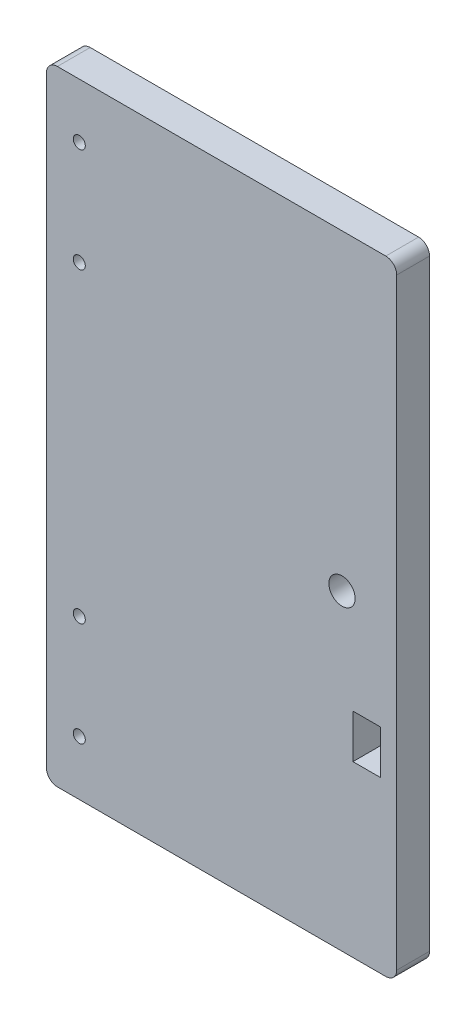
ISO-10303-21;
HEADER;
FILE_DESCRIPTION(('STEP AP214'),'2;1');
FILE_NAME('part.step','',(''),(''),'','','');
FILE_SCHEMA(('AUTOMOTIVE_DESIGN { 1 0 10303 214 1 1 1 1 }'));
ENDSEC;
DATA;
#1=APPLICATION_CONTEXT('core data for automotive mechanical design processes');
#2=APPLICATION_PROTOCOL_DEFINITION('international standard','automotive_design',2000,#1);
#3=PRODUCT_CONTEXT('',#1,'mechanical');
#4=PRODUCT('Part','Part','',(#3));
#5=PRODUCT_RELATED_PRODUCT_CATEGORY('part','',(#4));
#6=PRODUCT_DEFINITION_FORMATION('','',#4);
#7=PRODUCT_DEFINITION_CONTEXT('part definition',#1,'design');
#8=PRODUCT_DEFINITION('design','',#6,#7);
#9=PRODUCT_DEFINITION_SHAPE('','',#8);
#10=(LENGTH_UNIT() NAMED_UNIT(*) SI_UNIT(.MILLI.,.METRE.));
#11=(NAMED_UNIT(*) PLANE_ANGLE_UNIT() SI_UNIT($,.RADIAN.));
#12=(NAMED_UNIT(*) SI_UNIT($,.STERADIAN.) SOLID_ANGLE_UNIT());
#13=UNCERTAINTY_MEASURE_WITH_UNIT(LENGTH_MEASURE(1.E-05),#10,'distance_accuracy_value','');
#14=(GEOMETRIC_REPRESENTATION_CONTEXT(3) GLOBAL_UNCERTAINTY_ASSIGNED_CONTEXT((#13)) GLOBAL_UNIT_ASSIGNED_CONTEXT((#10,
#11,#12)) REPRESENTATION_CONTEXT('',''));
#15=CARTESIAN_POINT('',(0.,0.,0.));
#16=DIRECTION('',(0.,0.,1.));
#17=DIRECTION('',(1.,0.,0.));
#18=AXIS2_PLACEMENT_3D('',#15,#16,#17);
#19=CARTESIAN_POINT('',(2.,112.,6.));
#20=DIRECTION('',(0.,0.,-1.));
#21=DIRECTION('',(-1.,0.,0.));
#22=AXIS2_PLACEMENT_3D('',#19,#20,#21);
#23=CYLINDRICAL_SURFACE('',#22,2.);
#24=CARTESIAN_POINT('',(2.,112.,0.));
#25=DIRECTION('',(0.,0.,1.));
#26=DIRECTION('',(1.,0.,0.));
#27=AXIS2_PLACEMENT_3D('',#24,#25,#26);
#28=CIRCLE('',#27,2.);
#29=CARTESIAN_POINT('',(2.00000000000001,114.,0.));
#30=VERTEX_POINT('',#29);
#31=CARTESIAN_POINT('',(0.,112.,0.));
#32=VERTEX_POINT('',#31);
#33=EDGE_CURVE('E180',#30,#32,#28,.T.);
#34=ORIENTED_EDGE('',*,*,#33,.T.);
#35=DIRECTION('',(0.,0.,-1.));
#36=VECTOR('',#35,1.);
#37=CARTESIAN_POINT('',(0.,112.,6.));
#38=LINE('',#37,#36);
#39=CARTESIAN_POINT('',(0.,112.,6.));
#40=VERTEX_POINT('',#39);
#41=EDGE_CURVE('E11',#40,#32,#38,.T.);
#42=ORIENTED_EDGE('',*,*,#41,.F.);
#43=CARTESIAN_POINT('',(2.,112.,6.));
#44=DIRECTION('',(0.,0.,1.));
#45=DIRECTION('',(1.,0.,0.));
#46=AXIS2_PLACEMENT_3D('',#43,#44,#45);
#47=CIRCLE('',#46,2.);
#48=CARTESIAN_POINT('',(2.00000000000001,114.,6.));
#49=VERTEX_POINT('',#48);
#50=EDGE_CURVE('E197',#49,#40,#47,.T.);
#51=ORIENTED_EDGE('',*,*,#50,.F.);
#52=DIRECTION('',(0.,0.,-1.));
#53=VECTOR('',#52,1.);
#54=CARTESIAN_POINT('',(2.00000000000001,114.,6.));
#55=LINE('',#54,#53);
#56=EDGE_CURVE('E214',#49,#30,#55,.T.);
#57=ORIENTED_EDGE('',*,*,#56,.T.);
#58=EDGE_LOOP('',(#34,#42,#51,#57));
#59=FACE_BOUND('',#58,.T.);
#60=ADVANCED_FACE('F26',(#59),#23,.T.);
#61=CARTESIAN_POINT('',(0.,2.00000000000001,6.));
#62=DIRECTION('',(1.,0.,0.));
#63=DIRECTION('',(0.,0.,-1.));
#64=AXIS2_PLACEMENT_3D('',#61,#62,#63);
#65=PLANE('',#64);
#66=DIRECTION('',(0.,-1.,0.));
#67=VECTOR('',#66,1.);
#68=CARTESIAN_POINT('',(0.,2.00000000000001,0.));
#69=LINE('',#68,#67);
#70=CARTESIAN_POINT('',(0.,2.00000000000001,0.));
#71=VERTEX_POINT('',#70);
#72=EDGE_CURVE('E183',#32,#71,#69,.T.);
#73=ORIENTED_EDGE('',*,*,#72,.T.);
#74=DIRECTION('',(0.,0.,-1.));
#75=VECTOR('',#74,1.);
#76=CARTESIAN_POINT('',(0.,2.00000000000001,6.));
#77=LINE('',#76,#75);
#78=CARTESIAN_POINT('',(0.,2.00000000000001,6.));
#79=VERTEX_POINT('',#78);
#80=EDGE_CURVE('E33',#79,#71,#77,.T.);
#81=ORIENTED_EDGE('',*,*,#80,.F.);
#82=DIRECTION('',(0.,-1.,0.));
#83=VECTOR('',#82,1.);
#84=CARTESIAN_POINT('',(0.,2.00000000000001,6.));
#85=LINE('',#84,#83);
#86=EDGE_CURVE('E200',#40,#79,#85,.T.);
#87=ORIENTED_EDGE('',*,*,#86,.F.);
#88=ORIENTED_EDGE('',*,*,#41,.T.);
#89=EDGE_LOOP('',(#73,#81,#87,#88));
#90=FACE_BOUND('',#89,.T.);
#91=ADVANCED_FACE('F258',(#90),#65,.F.);
#92=CARTESIAN_POINT('',(2.,2.,6.));
#93=DIRECTION('',(0.,0.,-1.));
#94=DIRECTION('',(-1.,0.,0.));
#95=AXIS2_PLACEMENT_3D('',#92,#93,#94);
#96=CYLINDRICAL_SURFACE('',#95,2.);
#97=CARTESIAN_POINT('',(2.,2.,0.));
#98=DIRECTION('',(0.,0.,1.));
#99=DIRECTION('',(-1.,0.,0.));
#100=AXIS2_PLACEMENT_3D('',#97,#98,#99);
#101=CIRCLE('',#100,2.);
#102=CARTESIAN_POINT('',(2.00000000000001,0.,0.));
#103=VERTEX_POINT('',#102);
#104=EDGE_CURVE('E185',#71,#103,#101,.T.);
#105=ORIENTED_EDGE('',*,*,#104,.T.);
#106=DIRECTION('',(0.,0.,-1.));
#107=VECTOR('',#106,1.);
#108=CARTESIAN_POINT('',(2.00000000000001,0.,6.));
#109=LINE('',#108,#107);
#110=CARTESIAN_POINT('',(2.00000000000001,0.,6.));
#111=VERTEX_POINT('',#110);
#112=EDGE_CURVE('E229',#111,#103,#109,.T.);
#113=ORIENTED_EDGE('',*,*,#112,.F.);
#114=CARTESIAN_POINT('',(2.,2.,6.));
#115=DIRECTION('',(0.,0.,1.));
#116=DIRECTION('',(-1.,0.,0.));
#117=AXIS2_PLACEMENT_3D('',#114,#115,#116);
#118=CIRCLE('',#117,2.);
#119=EDGE_CURVE('E202',#79,#111,#118,.T.);
#120=ORIENTED_EDGE('',*,*,#119,.F.);
#121=ORIENTED_EDGE('',*,*,#80,.T.);
#122=EDGE_LOOP('',(#105,#113,#120,#121));
#123=FACE_BOUND('',#122,.T.);
#124=ADVANCED_FACE('F236',(#123),#96,.T.);
#125=CARTESIAN_POINT('',(2.00000000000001,0.,6.));
#126=DIRECTION('',(0.,1.,0.));
#127=DIRECTION('',(0.,0.,1.));
#128=AXIS2_PLACEMENT_3D('',#125,#126,#127);
#129=PLANE('',#128);
#130=DIRECTION('',(1.,0.,0.));
#131=VECTOR('',#130,1.);
#132=CARTESIAN_POINT('',(2.00000000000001,0.,0.));
#133=LINE('',#132,#131);
#134=CARTESIAN_POINT('',(62.,0.,0.));
#135=VERTEX_POINT('',#134);
#136=EDGE_CURVE('E187',#103,#135,#133,.T.);
#137=ORIENTED_EDGE('',*,*,#136,.T.);
#138=DIRECTION('',(0.,0.,-1.));
#139=VECTOR('',#138,1.);
#140=CARTESIAN_POINT('',(62.,0.,6.));
#141=LINE('',#140,#139);
#142=CARTESIAN_POINT('',(62.,0.,6.));
#143=VERTEX_POINT('',#142);
#144=EDGE_CURVE('E226',#143,#135,#141,.T.);
#145=ORIENTED_EDGE('',*,*,#144,.F.);
#146=DIRECTION('',(1.,0.,0.));
#147=VECTOR('',#146,1.);
#148=CARTESIAN_POINT('',(2.00000000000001,0.,6.));
#149=LINE('',#148,#147);
#150=EDGE_CURVE('E204',#111,#143,#149,.T.);
#151=ORIENTED_EDGE('',*,*,#150,.F.);
#152=ORIENTED_EDGE('',*,*,#112,.T.);
#153=EDGE_LOOP('',(#137,#145,#151,#152));
#154=FACE_BOUND('',#153,.T.);
#155=ADVANCED_FACE('F247',(#154),#129,.F.);
#156=CARTESIAN_POINT('',(62.,2.,6.));
#157=DIRECTION('',(0.,0.,-1.));
#158=DIRECTION('',(-1.,0.,0.));
#159=AXIS2_PLACEMENT_3D('',#156,#157,#158);
#160=CYLINDRICAL_SURFACE('',#159,2.);
#161=CARTESIAN_POINT('',(62.,2.,0.));
#162=DIRECTION('',(0.,0.,1.));
#163=DIRECTION('',(-1.,0.,0.));
#164=AXIS2_PLACEMENT_3D('',#161,#162,#163);
#165=CIRCLE('',#164,2.);
#166=CARTESIAN_POINT('',(64.,2.00000000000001,0.));
#167=VERTEX_POINT('',#166);
#168=EDGE_CURVE('E189',#135,#167,#165,.T.);
#169=ORIENTED_EDGE('',*,*,#168,.T.);
#170=DIRECTION('',(0.,0.,-1.));
#171=VECTOR('',#170,1.);
#172=CARTESIAN_POINT('',(64.,2.00000000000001,6.));
#173=LINE('',#172,#171);
#174=CARTESIAN_POINT('',(64.,2.00000000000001,6.));
#175=VERTEX_POINT('',#174);
#176=EDGE_CURVE('E223',#175,#167,#173,.T.);
#177=ORIENTED_EDGE('',*,*,#176,.F.);
#178=CARTESIAN_POINT('',(62.,2.,6.));
#179=DIRECTION('',(0.,0.,1.));
#180=DIRECTION('',(-1.,0.,0.));
#181=AXIS2_PLACEMENT_3D('',#178,#179,#180);
#182=CIRCLE('',#181,2.);
#183=EDGE_CURVE('E206',#143,#175,#182,.T.);
#184=ORIENTED_EDGE('',*,*,#183,.F.);
#185=ORIENTED_EDGE('',*,*,#144,.T.);
#186=EDGE_LOOP('',(#169,#177,#184,#185));
#187=FACE_BOUND('',#186,.T.);
#188=ADVANCED_FACE('F251',(#187),#160,.T.);
#189=CARTESIAN_POINT('',(64.,2.00000000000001,6.));
#190=DIRECTION('',(-1.,0.,0.));
#191=DIRECTION('',(0.,0.,1.));
#192=AXIS2_PLACEMENT_3D('',#189,#190,#191);
#193=PLANE('',#192);
#194=DIRECTION('',(0.,1.,0.));
#195=VECTOR('',#194,1.);
#196=CARTESIAN_POINT('',(64.,2.00000000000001,0.));
#197=LINE('',#196,#195);
#198=CARTESIAN_POINT('',(64.,112.,0.));
#199=VERTEX_POINT('',#198);
#200=EDGE_CURVE('E191',#167,#199,#197,.T.);
#201=ORIENTED_EDGE('',*,*,#200,.T.);
#202=DIRECTION('',(0.,0.,-1.));
#203=VECTOR('',#202,1.);
#204=CARTESIAN_POINT('',(64.,112.,6.));
#205=LINE('',#204,#203);
#206=CARTESIAN_POINT('',(64.,112.,6.));
#207=VERTEX_POINT('',#206);
#208=EDGE_CURVE('E220',#207,#199,#205,.T.);
#209=ORIENTED_EDGE('',*,*,#208,.F.);
#210=DIRECTION('',(0.,1.,0.));
#211=VECTOR('',#210,1.);
#212=CARTESIAN_POINT('',(64.,2.00000000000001,6.));
#213=LINE('',#212,#211);
#214=EDGE_CURVE('E208',#175,#207,#213,.T.);
#215=ORIENTED_EDGE('',*,*,#214,.F.);
#216=ORIENTED_EDGE('',*,*,#176,.T.);
#217=EDGE_LOOP('',(#201,#209,#215,#216));
#218=FACE_BOUND('',#217,.T.);
#219=ADVANCED_FACE('F271',(#218),#193,.F.);
#220=CARTESIAN_POINT('',(62.,112.,6.));
#221=DIRECTION('',(0.,0.,-1.));
#222=DIRECTION('',(-1.,0.,0.));
#223=AXIS2_PLACEMENT_3D('',#220,#221,#222);
#224=CYLINDRICAL_SURFACE('',#223,2.);
#225=CARTESIAN_POINT('',(62.,112.,0.));
#226=DIRECTION('',(0.,0.,1.));
#227=DIRECTION('',(-1.,0.,0.));
#228=AXIS2_PLACEMENT_3D('',#225,#226,#227);
#229=CIRCLE('',#228,2.);
#230=CARTESIAN_POINT('',(62.,114.,0.));
#231=VERTEX_POINT('',#230);
#232=EDGE_CURVE('E193',#199,#231,#229,.T.);
#233=ORIENTED_EDGE('',*,*,#232,.T.);
#234=DIRECTION('',(0.,0.,-1.));
#235=VECTOR('',#234,1.);
#236=CARTESIAN_POINT('',(62.,114.,6.));
#237=LINE('',#236,#235);
#238=CARTESIAN_POINT('',(62.,114.,6.));
#239=VERTEX_POINT('',#238);
#240=EDGE_CURVE('E217',#239,#231,#237,.T.);
#241=ORIENTED_EDGE('',*,*,#240,.F.);
#242=CARTESIAN_POINT('',(62.,112.,6.));
#243=DIRECTION('',(0.,0.,1.));
#244=DIRECTION('',(-1.,0.,0.));
#245=AXIS2_PLACEMENT_3D('',#242,#243,#244);
#246=CIRCLE('',#245,2.);
#247=EDGE_CURVE('E210',#207,#239,#246,.T.);
#248=ORIENTED_EDGE('',*,*,#247,.F.);
#249=ORIENTED_EDGE('',*,*,#208,.T.);
#250=EDGE_LOOP('',(#233,#241,#248,#249));
#251=FACE_BOUND('',#250,.T.);
#252=ADVANCED_FACE('F269',(#251),#224,.T.);
#253=CARTESIAN_POINT('',(2.00000000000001,114.,6.));
#254=DIRECTION('',(0.,-1.,0.));
#255=DIRECTION('',(1.,0.,0.));
#256=AXIS2_PLACEMENT_3D('',#253,#254,#255);
#257=PLANE('',#256);
#258=DIRECTION('',(-1.,0.,0.));
#259=VECTOR('',#258,1.);
#260=CARTESIAN_POINT('',(2.00000000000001,114.,0.));
#261=LINE('',#260,#259);
#262=EDGE_CURVE('E195',#231,#30,#261,.T.);
#263=ORIENTED_EDGE('',*,*,#262,.T.);
#264=ORIENTED_EDGE('',*,*,#56,.F.);
#265=DIRECTION('',(-1.,0.,0.));
#266=VECTOR('',#265,1.);
#267=CARTESIAN_POINT('',(2.00000000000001,114.,6.));
#268=LINE('',#267,#266);
#269=EDGE_CURVE('E212',#239,#49,#268,.T.);
#270=ORIENTED_EDGE('',*,*,#269,.F.);
#271=ORIENTED_EDGE('',*,*,#240,.T.);
#272=EDGE_LOOP('',(#263,#264,#270,#271));
#273=FACE_BOUND('',#272,.T.);
#274=ADVANCED_FACE('F264',(#273),#257,.F.);
#275=CARTESIAN_POINT('',(2.,112.,6.));
#276=DIRECTION('',(0.,0.,1.));
#277=DIRECTION('',(1.,0.,0.));
#278=AXIS2_PLACEMENT_3D('',#275,#276,#277);
#279=PLANE('',#278);
#280=DIRECTION('',(0.,-1.,0.));
#281=VECTOR('',#280,1.);
#282=CARTESIAN_POINT('',(56.,39.,6.));
#283=LINE('',#282,#281);
#284=CARTESIAN_POINT('',(56.,39.,6.));
#285=VERTEX_POINT('',#284);
#286=CARTESIAN_POINT('',(56.,31.,6.));
#287=VERTEX_POINT('',#286);
#288=EDGE_CURVE('E40',#285,#287,#283,.T.);
#289=ORIENTED_EDGE('',*,*,#288,.F.);
#290=DIRECTION('',(-1.,0.,0.));
#291=VECTOR('',#290,1.);
#292=CARTESIAN_POINT('',(56.,39.,6.));
#293=LINE('',#292,#291);
#294=CARTESIAN_POINT('',(61.,39.,6.));
#295=VERTEX_POINT('',#294);
#296=EDGE_CURVE('E132',#295,#285,#293,.T.);
#297=ORIENTED_EDGE('',*,*,#296,.F.);
#298=DIRECTION('',(0.,1.,0.));
#299=VECTOR('',#298,1.);
#300=CARTESIAN_POINT('',(61.,39.,6.));
#301=LINE('',#300,#299);
#302=CARTESIAN_POINT('',(61.,31.,6.));
#303=VERTEX_POINT('',#302);
#304=EDGE_CURVE('E116',#303,#295,#301,.T.);
#305=ORIENTED_EDGE('',*,*,#304,.F.);
#306=DIRECTION('',(1.,0.,0.));
#307=VECTOR('',#306,1.);
#308=CARTESIAN_POINT('',(56.,31.,6.));
#309=LINE('',#308,#307);
#310=EDGE_CURVE('E125',#287,#303,#309,.T.);
#311=ORIENTED_EDGE('',*,*,#310,.F.);
#312=EDGE_LOOP('',(#289,#297,#305,#311));
#313=FACE_BOUND('',#312,.T.);
#314=CARTESIAN_POINT('',(6.00000000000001,10.,6.));
#315=DIRECTION('',(0.,0.,1.));
#316=DIRECTION('',(1.,0.,0.));
#317=AXIS2_PLACEMENT_3D('',#314,#315,#316);
#318=CIRCLE('',#317,1.1);
#319=CARTESIAN_POINT('',(7.10000000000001,10.,6.));
#320=VERTEX_POINT('',#319);
#321=EDGE_CURVE('E148',#320,#320,#318,.T.);
#322=ORIENTED_EDGE('',*,*,#321,.F.);
#323=EDGE_LOOP('',(#322));
#324=FACE_BOUND('',#323,.T.);
#325=CARTESIAN_POINT('',(6.00000000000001,29.,6.));
#326=DIRECTION('',(0.,0.,1.));
#327=DIRECTION('',(1.,0.,0.));
#328=AXIS2_PLACEMENT_3D('',#325,#326,#327);
#329=CIRCLE('',#328,1.1);
#330=CARTESIAN_POINT('',(7.10000000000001,29.,6.));
#331=VERTEX_POINT('',#330);
#332=EDGE_CURVE('E156',#331,#331,#329,.T.);
#333=ORIENTED_EDGE('',*,*,#332,.F.);
#334=EDGE_LOOP('',(#333));
#335=FACE_BOUND('',#334,.T.);
#336=CARTESIAN_POINT('',(6.00000000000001,85.,6.));
#337=DIRECTION('',(0.,0.,1.));
#338=DIRECTION('',(1.,0.,0.));
#339=AXIS2_PLACEMENT_3D('',#336,#337,#338);
#340=CIRCLE('',#339,1.1);
#341=CARTESIAN_POINT('',(7.10000000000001,85.,6.));
#342=VERTEX_POINT('',#341);
#343=EDGE_CURVE('E162',#342,#342,#340,.T.);
#344=ORIENTED_EDGE('',*,*,#343,.F.);
#345=EDGE_LOOP('',(#344));
#346=FACE_BOUND('',#345,.T.);
#347=CARTESIAN_POINT('',(6.,104.,6.));
#348=DIRECTION('',(0.,0.,1.));
#349=DIRECTION('',(1.,0.,0.));
#350=AXIS2_PLACEMENT_3D('',#347,#348,#349);
#351=CIRCLE('',#350,1.1);
#352=CARTESIAN_POINT('',(7.1,104.,6.));
#353=VERTEX_POINT('',#352);
#354=EDGE_CURVE('E168',#353,#353,#351,.T.);
#355=ORIENTED_EDGE('',*,*,#354,.F.);
#356=EDGE_LOOP('',(#355));
#357=FACE_BOUND('',#356,.T.);
#358=CARTESIAN_POINT('',(54.,57.,6.));
#359=DIRECTION('',(0.,0.,1.));
#360=DIRECTION('',(1.,0.,0.));
#361=AXIS2_PLACEMENT_3D('',#358,#359,#360);
#362=CIRCLE('',#361,2.4);
#363=CARTESIAN_POINT('',(56.4,57.,6.));
#364=VERTEX_POINT('',#363);
#365=EDGE_CURVE('E174',#364,#364,#362,.T.);
#366=ORIENTED_EDGE('',*,*,#365,.F.);
#367=EDGE_LOOP('',(#366));
#368=FACE_BOUND('',#367,.T.);
#369=ORIENTED_EDGE('',*,*,#50,.T.);
#370=ORIENTED_EDGE('',*,*,#86,.T.);
#371=ORIENTED_EDGE('',*,*,#119,.T.);
#372=ORIENTED_EDGE('',*,*,#150,.T.);
#373=ORIENTED_EDGE('',*,*,#183,.T.);
#374=ORIENTED_EDGE('',*,*,#214,.T.);
#375=ORIENTED_EDGE('',*,*,#247,.T.);
#376=ORIENTED_EDGE('',*,*,#269,.T.);
#377=EDGE_LOOP('',(#369,#370,#371,#372,#373,#374,#375,#376));
#378=FACE_BOUND('',#377,.T.);
#379=ADVANCED_FACE('F129',(#313,#324,#335,#346,#357,#368,#378),#279,.T.);
#380=CARTESIAN_POINT('',(2.,112.,0.));
#381=DIRECTION('',(0.,0.,1.));
#382=DIRECTION('',(1.,0.,0.));
#383=AXIS2_PLACEMENT_3D('',#380,#381,#382);
#384=PLANE('',#383);
#385=DIRECTION('',(-1.,0.,0.));
#386=VECTOR('',#385,1.);
#387=CARTESIAN_POINT('',(56.,39.,0.));
#388=LINE('',#387,#386);
#389=CARTESIAN_POINT('',(61.,39.,0.));
#390=VERTEX_POINT('',#389);
#391=CARTESIAN_POINT('',(56.,39.,0.));
#392=VERTEX_POINT('',#391);
#393=EDGE_CURVE('E143',#390,#392,#388,.T.);
#394=ORIENTED_EDGE('',*,*,#393,.T.);
#395=DIRECTION('',(0.,-1.,0.));
#396=VECTOR('',#395,1.);
#397=CARTESIAN_POINT('',(56.,39.,0.));
#398=LINE('',#397,#396);
#399=CARTESIAN_POINT('',(56.,31.,0.));
#400=VERTEX_POINT('',#399);
#401=EDGE_CURVE('E134',#392,#400,#398,.T.);
#402=ORIENTED_EDGE('',*,*,#401,.T.);
#403=DIRECTION('',(1.,0.,0.));
#404=VECTOR('',#403,1.);
#405=CARTESIAN_POINT('',(56.,31.,0.));
#406=LINE('',#405,#404);
#407=CARTESIAN_POINT('',(61.,31.,0.));
#408=VERTEX_POINT('',#407);
#409=EDGE_CURVE('E140',#400,#408,#406,.T.);
#410=ORIENTED_EDGE('',*,*,#409,.T.);
#411=DIRECTION('',(0.,1.,0.));
#412=VECTOR('',#411,1.);
#413=CARTESIAN_POINT('',(61.,39.,0.));
#414=LINE('',#413,#412);
#415=EDGE_CURVE('E48',#408,#390,#414,.T.);
#416=ORIENTED_EDGE('',*,*,#415,.T.);
#417=EDGE_LOOP('',(#394,#402,#410,#416));
#418=FACE_BOUND('',#417,.T.);
#419=CARTESIAN_POINT('',(6.00000000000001,10.,0.));
#420=DIRECTION('',(0.,0.,1.));
#421=DIRECTION('',(1.,0.,0.));
#422=AXIS2_PLACEMENT_3D('',#419,#420,#421);
#423=CIRCLE('',#422,1.1);
#424=CARTESIAN_POINT('',(7.10000000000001,10.,0.));
#425=VERTEX_POINT('',#424);
#426=EDGE_CURVE('E153',#425,#425,#423,.T.);
#427=ORIENTED_EDGE('',*,*,#426,.T.);
#428=EDGE_LOOP('',(#427));
#429=FACE_BOUND('',#428,.T.);
#430=CARTESIAN_POINT('',(6.00000000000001,29.,0.));
#431=DIRECTION('',(0.,0.,1.));
#432=DIRECTION('',(1.,0.,0.));
#433=AXIS2_PLACEMENT_3D('',#430,#431,#432);
#434=CIRCLE('',#433,1.1);
#435=CARTESIAN_POINT('',(7.10000000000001,29.,0.));
#436=VERTEX_POINT('',#435);
#437=EDGE_CURVE('E159',#436,#436,#434,.T.);
#438=ORIENTED_EDGE('',*,*,#437,.T.);
#439=EDGE_LOOP('',(#438));
#440=FACE_BOUND('',#439,.T.);
#441=CARTESIAN_POINT('',(6.00000000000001,85.,0.));
#442=DIRECTION('',(0.,0.,1.));
#443=DIRECTION('',(1.,0.,0.));
#444=AXIS2_PLACEMENT_3D('',#441,#442,#443);
#445=CIRCLE('',#444,1.1);
#446=CARTESIAN_POINT('',(7.10000000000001,85.,0.));
#447=VERTEX_POINT('',#446);
#448=EDGE_CURVE('E165',#447,#447,#445,.T.);
#449=ORIENTED_EDGE('',*,*,#448,.T.);
#450=EDGE_LOOP('',(#449));
#451=FACE_BOUND('',#450,.T.);
#452=CARTESIAN_POINT('',(6.,104.,0.));
#453=DIRECTION('',(0.,0.,1.));
#454=DIRECTION('',(1.,0.,0.));
#455=AXIS2_PLACEMENT_3D('',#452,#453,#454);
#456=CIRCLE('',#455,1.1);
#457=CARTESIAN_POINT('',(7.1,104.,0.));
#458=VERTEX_POINT('',#457);
#459=EDGE_CURVE('E171',#458,#458,#456,.T.);
#460=ORIENTED_EDGE('',*,*,#459,.T.);
#461=EDGE_LOOP('',(#460));
#462=FACE_BOUND('',#461,.T.);
#463=CARTESIAN_POINT('',(54.,57.,0.));
#464=DIRECTION('',(0.,0.,1.));
#465=DIRECTION('',(1.,0.,0.));
#466=AXIS2_PLACEMENT_3D('',#463,#464,#465);
#467=CIRCLE('',#466,2.4);
#468=CARTESIAN_POINT('',(56.4,57.,0.));
#469=VERTEX_POINT('',#468);
#470=EDGE_CURVE('E177',#469,#469,#467,.T.);
#471=ORIENTED_EDGE('',*,*,#470,.T.);
#472=EDGE_LOOP('',(#471));
#473=FACE_BOUND('',#472,.T.);
#474=ORIENTED_EDGE('',*,*,#33,.F.);
#475=ORIENTED_EDGE('',*,*,#262,.F.);
#476=ORIENTED_EDGE('',*,*,#232,.F.);
#477=ORIENTED_EDGE('',*,*,#200,.F.);
#478=ORIENTED_EDGE('',*,*,#168,.F.);
#479=ORIENTED_EDGE('',*,*,#136,.F.);
#480=ORIENTED_EDGE('',*,*,#104,.F.);
#481=ORIENTED_EDGE('',*,*,#72,.F.);
#482=EDGE_LOOP('',(#474,#475,#476,#477,#478,#479,#480,#481));
#483=FACE_BOUND('',#482,.T.);
#484=ADVANCED_FACE('F242',(#418,#429,#440,#451,#462,#473,#483),#384,.F.);
#485=CARTESIAN_POINT('',(54.,57.,0.));
#486=DIRECTION('',(0.,0.,1.));
#487=DIRECTION('',(1.,0.,0.));
#488=AXIS2_PLACEMENT_3D('',#485,#486,#487);
#489=CYLINDRICAL_SURFACE('',#488,2.4);
#490=ORIENTED_EDGE('',*,*,#470,.F.);
#491=EDGE_LOOP('',(#490));
#492=FACE_BOUND('',#491,.T.);
#493=ORIENTED_EDGE('',*,*,#365,.T.);
#494=EDGE_LOOP('',(#493));
#495=FACE_BOUND('',#494,.T.);
#496=ADVANCED_FACE('F323',(#492,#495),#489,.F.);
#497=CARTESIAN_POINT('',(6.,104.,0.));
#498=DIRECTION('',(0.,0.,1.));
#499=DIRECTION('',(1.,0.,0.));
#500=AXIS2_PLACEMENT_3D('',#497,#498,#499);
#501=CYLINDRICAL_SURFACE('',#500,1.1);
#502=ORIENTED_EDGE('',*,*,#459,.F.);
#503=EDGE_LOOP('',(#502));
#504=FACE_BOUND('',#503,.T.);
#505=ORIENTED_EDGE('',*,*,#354,.T.);
#506=EDGE_LOOP('',(#505));
#507=FACE_BOUND('',#506,.T.);
#508=ADVANCED_FACE('F331',(#504,#507),#501,.F.);
#509=CARTESIAN_POINT('',(6.00000000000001,85.,0.));
#510=DIRECTION('',(0.,0.,1.));
#511=DIRECTION('',(1.,0.,0.));
#512=AXIS2_PLACEMENT_3D('',#509,#510,#511);
#513=CYLINDRICAL_SURFACE('',#512,1.1);
#514=ORIENTED_EDGE('',*,*,#448,.F.);
#515=EDGE_LOOP('',(#514));
#516=FACE_BOUND('',#515,.T.);
#517=ORIENTED_EDGE('',*,*,#343,.T.);
#518=EDGE_LOOP('',(#517));
#519=FACE_BOUND('',#518,.T.);
#520=ADVANCED_FACE('F339',(#516,#519),#513,.F.);
#521=CARTESIAN_POINT('',(6.00000000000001,29.,0.));
#522=DIRECTION('',(0.,0.,1.));
#523=DIRECTION('',(1.,0.,0.));
#524=AXIS2_PLACEMENT_3D('',#521,#522,#523);
#525=CYLINDRICAL_SURFACE('',#524,1.1);
#526=ORIENTED_EDGE('',*,*,#437,.F.);
#527=EDGE_LOOP('',(#526));
#528=FACE_BOUND('',#527,.T.);
#529=ORIENTED_EDGE('',*,*,#332,.T.);
#530=EDGE_LOOP('',(#529));
#531=FACE_BOUND('',#530,.T.);
#532=ADVANCED_FACE('F347',(#528,#531),#525,.F.);
#533=CARTESIAN_POINT('',(6.00000000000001,10.,0.));
#534=DIRECTION('',(0.,0.,1.));
#535=DIRECTION('',(1.,0.,0.));
#536=AXIS2_PLACEMENT_3D('',#533,#534,#535);
#537=CYLINDRICAL_SURFACE('',#536,1.1);
#538=ORIENTED_EDGE('',*,*,#426,.F.);
#539=EDGE_LOOP('',(#538));
#540=FACE_BOUND('',#539,.T.);
#541=ORIENTED_EDGE('',*,*,#321,.T.);
#542=EDGE_LOOP('',(#541));
#543=FACE_BOUND('',#542,.T.);
#544=ADVANCED_FACE('F355',(#540,#543),#537,.F.);
#545=CARTESIAN_POINT('',(56.,39.,0.));
#546=DIRECTION('',(-1.,0.,0.));
#547=DIRECTION('',(0.,-1.,0.));
#548=AXIS2_PLACEMENT_3D('',#545,#546,#547);
#549=PLANE('',#548);
#550=ORIENTED_EDGE('',*,*,#288,.T.);
#551=DIRECTION('',(0.,0.,1.));
#552=VECTOR('',#551,1.);
#553=CARTESIAN_POINT('',(56.,31.,0.));
#554=LINE('',#553,#552);
#555=EDGE_CURVE('E122',#400,#287,#554,.T.);
#556=ORIENTED_EDGE('',*,*,#555,.F.);
#557=ORIENTED_EDGE('',*,*,#401,.F.);
#558=DIRECTION('',(0.,0.,1.));
#559=VECTOR('',#558,1.);
#560=CARTESIAN_POINT('',(56.,39.,0.));
#561=LINE('',#560,#559);
#562=EDGE_CURVE('E146',#392,#285,#561,.T.);
#563=ORIENTED_EDGE('',*,*,#562,.T.);
#564=EDGE_LOOP('',(#550,#556,#557,#563));
#565=FACE_BOUND('',#564,.T.);
#566=ADVANCED_FACE('F363',(#565),#549,.F.);
#567=CARTESIAN_POINT('',(56.,39.,0.));
#568=DIRECTION('',(0.,1.,0.));
#569=DIRECTION('',(0.,0.,1.));
#570=AXIS2_PLACEMENT_3D('',#567,#568,#569);
#571=PLANE('',#570);
#572=ORIENTED_EDGE('',*,*,#296,.T.);
#573=ORIENTED_EDGE('',*,*,#562,.F.);
#574=ORIENTED_EDGE('',*,*,#393,.F.);
#575=DIRECTION('',(0.,0.,1.));
#576=VECTOR('',#575,1.);
#577=CARTESIAN_POINT('',(61.,39.,0.));
#578=LINE('',#577,#576);
#579=EDGE_CURVE('E121',#390,#295,#578,.T.);
#580=ORIENTED_EDGE('',*,*,#579,.T.);
#581=EDGE_LOOP('',(#572,#573,#574,#580));
#582=FACE_BOUND('',#581,.T.);
#583=ADVANCED_FACE('F371',(#582),#571,.F.);
#584=CARTESIAN_POINT('',(61.,39.,0.));
#585=DIRECTION('',(1.,0.,0.));
#586=DIRECTION('',(0.,0.,-1.));
#587=AXIS2_PLACEMENT_3D('',#584,#585,#586);
#588=PLANE('',#587);
#589=ORIENTED_EDGE('',*,*,#304,.T.);
#590=ORIENTED_EDGE('',*,*,#579,.F.);
#591=ORIENTED_EDGE('',*,*,#415,.F.);
#592=DIRECTION('',(0.,0.,1.));
#593=VECTOR('',#592,1.);
#594=CARTESIAN_POINT('',(61.,31.,0.));
#595=LINE('',#594,#593);
#596=EDGE_CURVE('E112',#408,#303,#595,.T.);
#597=ORIENTED_EDGE('',*,*,#596,.T.);
#598=EDGE_LOOP('',(#589,#590,#591,#597));
#599=FACE_BOUND('',#598,.T.);
#600=ADVANCED_FACE('F114',(#599),#588,.F.);
#601=CARTESIAN_POINT('',(56.,31.,0.));
#602=DIRECTION('',(0.,-1.,0.));
#603=DIRECTION('',(0.,0.,-1.));
#604=AXIS2_PLACEMENT_3D('',#601,#602,#603);
#605=PLANE('',#604);
#606=ORIENTED_EDGE('',*,*,#310,.T.);
#607=ORIENTED_EDGE('',*,*,#596,.F.);
#608=ORIENTED_EDGE('',*,*,#409,.F.);
#609=ORIENTED_EDGE('',*,*,#555,.T.);
#610=EDGE_LOOP('',(#606,#607,#608,#609));
#611=FACE_BOUND('',#610,.T.);
#612=ADVANCED_FACE('F126',(#611),#605,.F.);
#613=CLOSED_SHELL('',(#60,#91,#124,#155,#188,#219,#252,#274,#379,#484,#496,#508,#520,#532,#544,
#566,#583,#600,#612));
#614=MANIFOLD_SOLID_BREP('B2',#613);
#615=ADVANCED_BREP_SHAPE_REPRESENTATION('',(#18,#614),#14);
#616=SHAPE_DEFINITION_REPRESENTATION(#9,#615);
ENDSEC;
END-ISO-10303-21;
